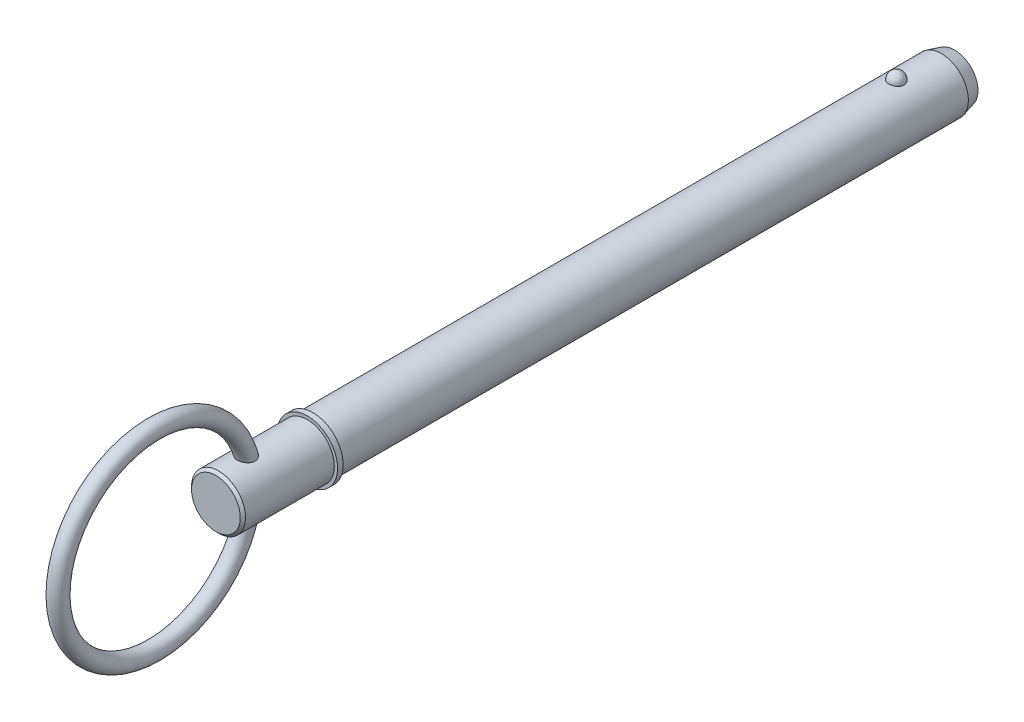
ISO-10303-21;
HEADER;
FILE_DESCRIPTION(('STEP AP214'),'2;1');
FILE_NAME('part.step','',(''),(''),'','','');
FILE_SCHEMA(('AUTOMOTIVE_DESIGN { 1 0 10303 214 1 1 1 1 }'));
ENDSEC;
DATA;
#1=APPLICATION_CONTEXT('core data for automotive mechanical design processes');
#2=APPLICATION_PROTOCOL_DEFINITION('international standard','automotive_design',2000,#1);
#3=PRODUCT_CONTEXT('',#1,'mechanical');
#4=PRODUCT('Part','Part','',(#3));
#5=PRODUCT_RELATED_PRODUCT_CATEGORY('part','',(#4));
#6=PRODUCT_DEFINITION_FORMATION('','',#4);
#7=PRODUCT_DEFINITION_CONTEXT('part definition',#1,'design');
#8=PRODUCT_DEFINITION('design','',#6,#7);
#9=PRODUCT_DEFINITION_SHAPE('','',#8);
#10=(LENGTH_UNIT() NAMED_UNIT(*) SI_UNIT(.MILLI.,.METRE.));
#11=(NAMED_UNIT(*) PLANE_ANGLE_UNIT() SI_UNIT($,.RADIAN.));
#12=(NAMED_UNIT(*) SI_UNIT($,.STERADIAN.) SOLID_ANGLE_UNIT());
#13=UNCERTAINTY_MEASURE_WITH_UNIT(LENGTH_MEASURE(1.E-05),#10,'distance_accuracy_value','');
#14=(GEOMETRIC_REPRESENTATION_CONTEXT(3) GLOBAL_UNCERTAINTY_ASSIGNED_CONTEXT((#13)) GLOBAL_UNIT_ASSIGNED_CONTEXT((#10,
#11,#12)) REPRESENTATION_CONTEXT('',''));
#15=CARTESIAN_POINT('',(0.,0.,0.));
#16=DIRECTION('',(0.,0.,1.));
#17=DIRECTION('',(1.,0.,0.));
#18=AXIS2_PLACEMENT_3D('',#15,#16,#17);
#19=CARTESIAN_POINT('',(0.,0.,152.4));
#20=DIRECTION('',(0.,0.,-1.));
#21=DIRECTION('',(-1.,0.,0.));
#22=AXIS2_PLACEMENT_3D('',#19,#20,#21);
#23=CYLINDRICAL_SURFACE('',#22,7.145);
#24=CARTESIAN_POINT('',(1.99971637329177,6.85945766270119,-2.01999999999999));
#25=CARTESIAN_POINT('',(1.9997145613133,6.85945924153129,-1.90709736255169));
#26=CARTESIAN_POINT('',(1.99051486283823,6.86216053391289,-1.79417185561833));
#27=CARTESIAN_POINT('',(1.95393597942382,6.87266409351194,-1.57152267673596));
#28=CARTESIAN_POINT('',(1.92655029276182,6.88046818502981,-1.46180016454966));
#29=CARTESIAN_POINT('',(1.85429435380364,6.90029063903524,-1.24873107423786));
#30=CARTESIAN_POINT('',(1.80943177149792,6.91230715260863,-1.14538172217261));
#31=CARTESIAN_POINT('',(1.70333474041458,6.93921158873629,-0.947875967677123));
#32=CARTESIAN_POINT('',(1.64210059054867,6.95409945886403,-0.853719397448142));
#33=CARTESIAN_POINT('',(1.5044381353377,6.98517577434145,-0.676721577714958));
#34=CARTESIAN_POINT('',(1.42793505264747,7.00137037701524,-0.593939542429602));
#35=CARTESIAN_POINT('',(1.26189697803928,7.03319066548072,-0.442536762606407));
#36=CARTESIAN_POINT('',(1.17236198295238,7.04881635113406,-0.373916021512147));
#37=CARTESIAN_POINT('',(0.9829322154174,7.0777121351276,-0.252935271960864));
#38=CARTESIAN_POINT('',(0.88306843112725,7.09098897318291,-0.200528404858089));
#39=CARTESIAN_POINT('',(0.675560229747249,7.11375589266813,-0.113212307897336));
#40=CARTESIAN_POINT('',(0.567916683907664,7.12324639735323,-0.0783011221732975));
#41=CARTESIAN_POINT('',(0.350006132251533,7.13724173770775,-0.0274707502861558));
#42=CARTESIAN_POINT('',(0.239822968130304,7.14183447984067,-0.0112162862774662));
#43=CARTESIAN_POINT('',(0.0181946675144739,7.14583597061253,0.00296794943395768));
#44=CARTESIAN_POINT('',(-0.093250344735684,7.14524522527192,0.000899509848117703));
#45=CARTESIAN_POINT('',(-0.31252760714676,7.13899247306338,-0.0213331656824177));
#46=CARTESIAN_POINT('',(-0.420388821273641,7.13340426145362,-0.0412340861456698));
#47=CARTESIAN_POINT('',(-0.631141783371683,7.11785474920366,-0.0982040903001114));
#48=CARTESIAN_POINT('',(-0.73403344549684,7.10789337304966,-0.135273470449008));
#49=CARTESIAN_POINT('',(-0.932634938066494,7.08458058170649,-0.225826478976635));
#50=CARTESIAN_POINT('',(-1.02829911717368,7.07120963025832,-0.279405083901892));
#51=CARTESIAN_POINT('',(-1.20927180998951,7.04252043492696,-0.401457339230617));
#52=CARTESIAN_POINT('',(-1.29457925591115,7.02720199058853,-0.469932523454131));
#53=CARTESIAN_POINT('',(-1.45423311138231,6.995926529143,-0.621438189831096));
#54=CARTESIAN_POINT('',(-1.5283348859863,6.97996288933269,-0.704725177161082));
#55=CARTESIAN_POINT('',(-1.66169281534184,6.94942414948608,-0.882667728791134));
#56=CARTESIAN_POINT('',(-1.72094789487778,6.93484915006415,-0.977324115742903));
#57=CARTESIAN_POINT('',(-1.82375276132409,6.90853186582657,-1.17661373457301));
#58=CARTESIAN_POINT('',(-1.86711024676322,6.8968248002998,-1.28135093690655));
#59=CARTESIAN_POINT('',(-1.9360425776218,6.87779420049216,-1.49689986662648));
#60=CARTESIAN_POINT('',(-1.96161794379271,6.87047053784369,-1.60771141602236));
#61=CARTESIAN_POINT('',(-1.99427437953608,6.86106309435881,-1.83176258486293));
#62=CARTESIAN_POINT('',(-2.00143373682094,6.8589571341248,-1.94498985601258));
#63=CARTESIAN_POINT('',(-1.99730449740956,6.86016064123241,-2.17107603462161));
#64=CARTESIAN_POINT('',(-1.98601641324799,6.86346995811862,-2.28393495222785));
#65=CARTESIAN_POINT('',(-1.94538181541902,6.87509649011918,-2.50548437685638));
#66=CARTESIAN_POINT('',(-1.91612773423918,6.88338806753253,-2.61419321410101));
#67=CARTESIAN_POINT('',(-1.84036449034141,6.90402888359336,-2.82501243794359));
#68=CARTESIAN_POINT('',(-1.79385462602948,6.91637828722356,-2.92712255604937));
#69=CARTESIAN_POINT('',(-1.68442067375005,6.94384180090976,-3.122477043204));
#70=CARTESIAN_POINT('',(-1.62140729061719,6.95897081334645,-3.21566929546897));
#71=CARTESIAN_POINT('',(-1.4806650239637,6.99026742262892,-3.38999412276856));
#72=CARTESIAN_POINT('',(-1.40293556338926,7.00643506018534,-3.47112622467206));
#73=CARTESIAN_POINT('',(-1.2344320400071,7.03807960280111,-3.61938672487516));
#74=CARTESIAN_POINT('',(-1.14360929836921,7.05355363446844,-3.68646046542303));
#75=CARTESIAN_POINT('',(-0.951591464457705,7.08201263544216,-3.80431973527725));
#76=CARTESIAN_POINT('',(-0.850397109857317,7.09499778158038,-3.85510642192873));
#77=CARTESIAN_POINT('',(-0.641823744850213,7.11687679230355,-3.93839532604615));
#78=CARTESIAN_POINT('',(-0.534539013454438,7.1258202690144,-3.97112042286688));
#79=CARTESIAN_POINT('',(-0.315743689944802,7.1388605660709,-4.01830716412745));
#80=CARTESIAN_POINT('',(-0.204233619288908,7.14295798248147,-4.03277105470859));
#81=CARTESIAN_POINT('',(0.0175518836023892,7.14582273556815,-4.04291389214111));
#82=CARTESIAN_POINT('',(0.12780991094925,7.14469090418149,-4.03894819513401));
#83=CARTESIAN_POINT('',(0.346044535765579,7.13745046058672,-4.01315850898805));
#84=CARTESIAN_POINT('',(0.454021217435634,7.13134203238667,-3.99133518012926));
#85=CARTESIAN_POINT('',(0.664227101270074,7.11483713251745,-3.93057164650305));
#86=CARTESIAN_POINT('',(0.766477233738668,7.10445761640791,-3.89169908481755));
#87=CARTESIAN_POINT('',(0.962929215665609,7.08050813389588,-3.79792023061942));
#88=CARTESIAN_POINT('',(1.05713054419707,7.06693796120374,-3.74301290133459));
#89=CARTESIAN_POINT('',(1.23644031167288,7.03780007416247,-3.61765173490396));
#90=CARTESIAN_POINT('',(1.32138387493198,7.0222044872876,-3.54696861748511));
#91=CARTESIAN_POINT('',(1.47830582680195,6.99085504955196,-3.39245228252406));
#92=CARTESIAN_POINT('',(1.55028198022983,6.97510117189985,-3.30861680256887));
#93=CARTESIAN_POINT('',(1.68063701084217,6.94485803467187,-3.12843058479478));
#94=CARTESIAN_POINT('',(1.73875175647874,6.93039619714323,-3.03188405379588));
#95=CARTESIAN_POINT('',(1.83823393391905,6.90467783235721,-2.83015210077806));
#96=CARTESIAN_POINT('',(1.87960712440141,6.89342020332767,-2.72496966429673));
#97=CARTESIAN_POINT('',(1.94111647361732,6.87633596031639,-2.52050234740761));
#98=CARTESIAN_POINT('',(1.96305249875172,6.87005682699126,-2.42179225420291));
#99=CARTESIAN_POINT('',(1.99235308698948,6.86161702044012,-2.22206084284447));
#100=CARTESIAN_POINT('',(1.99971799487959,6.85945624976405,-2.12103957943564));
#101=CARTESIAN_POINT('',(1.99971637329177,6.85945766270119,-2.01999999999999));
#102=B_SPLINE_CURVE_WITH_KNOTS('',3,(#24,#25,#26,#27,#28,#29,#30,#31,#32,#33,#34,#35,#36,#37,
#38,#39,#40,#41,#42,#43,#44,#45,#46,#47,#48,#49,#50,#51,#52,#53,#54,#55,#56,#57,#58,#59,#60,#61,
#62,#63,#64,#65,#66,#67,#68,#69,#70,#71,#72,#73,#74,#75,#76,#77,#78,#79,#80,#81,#82,#83,#84,#85,
#86,#87,#88,#89,#90,#91,#92,#93,#94,#95,#96,#97,#98,#99,#100,#101),.UNSPECIFIED.,.T.,.F.,(4,2,2,
2,2,2,2,2,2,2,2,2,2,2,2,2,2,2,2,2,2,2,2,2,2,2,2,2,2,2,2,2,2,2,2,2,2,2,4),(0.,0.338345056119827,
0.676811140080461,1.01512885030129,1.35344038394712,1.69345130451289,2.0334623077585,
2.37248128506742,2.71146235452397,3.04425125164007,3.37700766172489,3.70493009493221,
4.03285819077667,4.36270921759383,4.69259422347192,5.02887632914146,5.36518278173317,
5.70543263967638,6.04567253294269,6.38446363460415,6.72324532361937,7.0602984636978,
7.39736530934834,7.73629500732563,8.07523799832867,8.4154752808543,8.7556883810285,
9.09160363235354,9.42747756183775,9.7569023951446,10.0863150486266,10.4144324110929,
10.7425709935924,11.0758313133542,11.4091490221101,11.748385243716,12.0875046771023,
12.3903058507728,12.6930998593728),.UNSPECIFIED.);
#103=CARTESIAN_POINT('',(1.99971637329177,6.85945766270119,-2.01999999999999));
#104=VERTEX_POINT('',#103);
#105=EDGE_CURVE('E102',#104,#104,#102,.T.);
#106=ORIENTED_EDGE('',*,*,#105,.T.);
#107=EDGE_LOOP('',(#106));
#108=FACE_BOUND('',#107,.T.);
#109=CARTESIAN_POINT('',(0.,0.,-13.9500000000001));
#110=DIRECTION('',(0.,0.,-1.));
#111=DIRECTION('',(-1.,0.,0.));
#112=AXIS2_PLACEMENT_3D('',#109,#110,#111);
#113=CIRCLE('',#112,7.145);
#114=CARTESIAN_POINT('',(-7.145,0.,-13.9500000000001));
#115=VERTEX_POINT('',#114);
#116=EDGE_CURVE('E109',#115,#115,#113,.F.);
#117=ORIENTED_EDGE('',*,*,#116,.T.);
#118=EDGE_LOOP('',(#117));
#119=FACE_BOUND('',#118,.T.);
#120=CARTESIAN_POINT('',(0.,0.,152.4));
#121=DIRECTION('',(0.,0.,1.));
#122=DIRECTION('',(1.,0.,0.));
#123=AXIS2_PLACEMENT_3D('',#120,#121,#122);
#124=CIRCLE('',#123,7.145);
#125=CARTESIAN_POINT('',(7.145,0.,152.4));
#126=VERTEX_POINT('',#125);
#127=EDGE_CURVE('E107',#126,#126,#124,.T.);
#128=ORIENTED_EDGE('',*,*,#127,.F.);
#129=EDGE_LOOP('',(#128));
#130=FACE_BOUND('',#129,.T.);
#131=ADVANCED_FACE('F39',(#108,#119,#130),#23,.T.);
#132=CARTESIAN_POINT('',(0.,0.,-17.45));
#133=DIRECTION('',(0.,0.,-1.));
#134=DIRECTION('',(-1.,0.,0.));
#135=AXIS2_PLACEMENT_3D('',#132,#133,#134);
#136=PLANE('',#135);
#137=CARTESIAN_POINT('',(0.,0.,-17.45));
#138=DIRECTION('',(0.,0.,-1.));
#139=DIRECTION('',(-1.,0.,0.));
#140=AXIS2_PLACEMENT_3D('',#137,#138,#139);
#141=CIRCLE('',#140,6.20717782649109);
#142=CARTESIAN_POINT('',(-6.20717782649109,0.,-17.45));
#143=VERTEX_POINT('',#142);
#144=EDGE_CURVE('E143',#143,#143,#141,.T.);
#145=ORIENTED_EDGE('',*,*,#144,.T.);
#146=EDGE_LOOP('',(#145));
#147=FACE_BOUND('',#146,.T.);
#148=ADVANCED_FACE('F88',(#147),#136,.T.);
#149=CARTESIAN_POINT('',(0.,0.,-17.45));
#150=DIRECTION('',(0.,0.,1.));
#151=DIRECTION('',(1.,0.,0.));
#152=AXIS2_PLACEMENT_3D('',#149,#150,#151);
#153=CONICAL_SURFACE('',#152,6.20717782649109,0.261799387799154);
#154=ORIENTED_EDGE('',*,*,#116,.F.);
#155=EDGE_LOOP('',(#154));
#156=FACE_BOUND('',#155,.T.);
#157=ORIENTED_EDGE('',*,*,#144,.F.);
#158=EDGE_LOOP('',(#157));
#159=FACE_BOUND('',#158,.T.);
#160=ADVANCED_FACE('F94',(#156,#159),#153,.T.);
#161=CARTESIAN_POINT('',(0.,7.145,-2.01999999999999));
#162=DIRECTION('',(0.,1.,0.));
#163=DIRECTION('',(0.,0.,1.));
#164=AXIS2_PLACEMENT_3D('',#161,#162,#163);
#165=SPHERICAL_SURFACE('',#164,2.02);
#166=ORIENTED_EDGE('',*,*,#105,.F.);
#167=EDGE_LOOP('',(#166));
#168=FACE_BOUND('',#167,.T.);
#169=ADVANCED_FACE('F112',(#168),#165,.T.);
#170=CARTESIAN_POINT('',(0.,0.,152.4));
#171=DIRECTION('',(0.,0.,-1.));
#172=DIRECTION('',(-1.,0.,0.));
#173=AXIS2_PLACEMENT_3D('',#170,#171,#172);
#174=PLANE('',#173);
#175=ORIENTED_EDGE('',*,*,#127,.T.);
#176=EDGE_LOOP('',(#175));
#177=FACE_BOUND('',#176,.T.);
#178=CARTESIAN_POINT('',(0.,0.,152.4));
#179=DIRECTION('',(0.,0.,-1.));
#180=DIRECTION('',(-1.,0.,0.));
#181=AXIS2_PLACEMENT_3D('',#178,#179,#180);
#182=CIRCLE('',#181,8.);
#183=CARTESIAN_POINT('',(-8.,0.,152.4));
#184=VERTEX_POINT('',#183);
#185=EDGE_CURVE('E108',#184,#184,#182,.T.);
#186=ORIENTED_EDGE('',*,*,#185,.T.);
#187=EDGE_LOOP('',(#186));
#188=FACE_BOUND('',#187,.T.);
#189=ADVANCED_FACE('F116',(#177,#188),#174,.T.);
#190=CARTESIAN_POINT('',(0.,0.,33.7287874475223));
#191=DIRECTION('',(0.,0.,-1.));
#192=DIRECTION('',(-1.,0.,0.));
#193=AXIS2_PLACEMENT_3D('',#190,#191,#192);
#194=CYLINDRICAL_SURFACE('',#193,8.);
#195=CARTESIAN_POINT('',(0.,0.,153.9));
#196=DIRECTION('',(0.,0.,-1.));
#197=DIRECTION('',(-1.,0.,0.));
#198=AXIS2_PLACEMENT_3D('',#195,#196,#197);
#199=CIRCLE('',#198,8.);
#200=CARTESIAN_POINT('',(-8.,0.,153.9));
#201=VERTEX_POINT('',#200);
#202=EDGE_CURVE('E133',#201,#201,#199,.T.);
#203=ORIENTED_EDGE('',*,*,#202,.T.);
#204=EDGE_LOOP('',(#203));
#205=FACE_BOUND('',#204,.T.);
#206=ORIENTED_EDGE('',*,*,#185,.F.);
#207=EDGE_LOOP('',(#206));
#208=FACE_BOUND('',#207,.T.);
#209=ADVANCED_FACE('F120',(#205,#208),#194,.T.);
#210=CARTESIAN_POINT('',(0.,8.,153.9));
#211=DIRECTION('',(0.,0.,1.));
#212=DIRECTION('',(1.,0.,0.));
#213=AXIS2_PLACEMENT_3D('',#210,#211,#212);
#214=PLANE('',#213);
#215=CARTESIAN_POINT('',(0.,0.,153.9));
#216=DIRECTION('',(0.,0.,1.));
#217=DIRECTION('',(1.,0.,0.));
#218=AXIS2_PLACEMENT_3D('',#215,#216,#217);
#219=CIRCLE('',#218,7.145);
#220=CARTESIAN_POINT('',(7.145,0.,153.9));
#221=VERTEX_POINT('',#220);
#222=EDGE_CURVE('E111',#221,#221,#219,.T.);
#223=ORIENTED_EDGE('',*,*,#222,.F.);
#224=EDGE_LOOP('',(#223));
#225=FACE_BOUND('',#224,.T.);
#226=ORIENTED_EDGE('',*,*,#202,.F.);
#227=EDGE_LOOP('',(#226));
#228=FACE_BOUND('',#227,.T.);
#229=ADVANCED_FACE('F85',(#225,#228),#214,.T.);
#230=CARTESIAN_POINT('',(0.,0.,178.1));
#231=DIRECTION('',(0.,0.,-1.));
#232=DIRECTION('',(-1.,0.,0.));
#233=AXIS2_PLACEMENT_3D('',#230,#231,#232);
#234=CYLINDRICAL_SURFACE('',#233,7.145);
#235=CARTESIAN_POINT('',(-1.03551034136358,-7.0695645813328,168.030259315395));
#236=CARTESIAN_POINT('',(-0.923225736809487,-7.08601142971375,167.974402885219));
#237=CARTESIAN_POINT('',(-0.806039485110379,-7.10042113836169,167.927835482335));
#238=CARTESIAN_POINT('',(-0.565173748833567,-7.1236385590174,167.854279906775));
#239=CARTESIAN_POINT('',(-0.441495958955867,-7.13244772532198,167.827286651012));
#240=CARTESIAN_POINT('',(-0.191106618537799,-7.14354309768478,167.793450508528));
#241=CARTESIAN_POINT('',(-0.0643945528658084,-7.14582818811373,167.786611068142));
#242=CARTESIAN_POINT('',(0.188443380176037,-7.14363337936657,167.793241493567));
#243=CARTESIAN_POINT('',(0.31456922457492,-7.13915321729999,167.806712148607));
#244=CARTESIAN_POINT('',(0.562499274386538,-7.12390574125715,167.85364165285));
#245=CARTESIAN_POINT('',(0.684308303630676,-7.11314569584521,167.887077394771));
#246=CARTESIAN_POINT('',(0.920329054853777,-7.08647538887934,167.973194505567));
#247=CARTESIAN_POINT('',(1.0345403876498,-7.07056486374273,168.025876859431));
#248=CARTESIAN_POINT('',(1.2523263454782,-7.03526161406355,168.1494470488));
#249=CARTESIAN_POINT('',(1.35588248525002,-7.01586299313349,168.22036580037));
#250=CARTESIAN_POINT('',(1.54916093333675,-6.9757352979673,168.378757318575));
#251=CARTESIAN_POINT('',(1.63888414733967,-6.95500631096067,168.466229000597));
#252=CARTESIAN_POINT('',(1.80113983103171,-6.91475703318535,168.654727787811));
#253=CARTESIAN_POINT('',(1.87381924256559,-6.89522757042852,168.755626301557));
#254=CARTESIAN_POINT('',(2.00091178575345,-6.8594283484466,168.96884010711));
#255=CARTESIAN_POINT('',(2.05532963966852,-6.84315774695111,169.081152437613));
#256=CARTESIAN_POINT('',(2.14350100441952,-6.81604873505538,169.31119481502));
#257=CARTESIAN_POINT('',(2.17770329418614,-6.80509340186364,169.428739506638));
#258=CARTESIAN_POINT('',(2.22691394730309,-6.7891497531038,169.668149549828));
#259=CARTESIAN_POINT('',(2.2419216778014,-6.7841616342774,169.790015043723));
#260=CARTESIAN_POINT('',(2.25313992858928,-6.78044381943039,170.03580699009));
#261=CARTESIAN_POINT('',(2.24917302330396,-6.78177319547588,170.159742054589));
#262=CARTESIAN_POINT('',(2.22301329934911,-6.79039131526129,170.405438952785));
#263=CARTESIAN_POINT('',(2.20081491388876,-6.79768187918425,170.5272001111));
#264=CARTESIAN_POINT('',(2.13702421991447,-6.81801706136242,170.775287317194));
#265=CARTESIAN_POINT('',(2.09404815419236,-6.83146790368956,170.901223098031));
#266=CARTESIAN_POINT('',(1.98986384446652,-6.86253672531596,171.144824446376));
#267=CARTESIAN_POINT('',(1.92864130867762,-6.88015796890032,171.262483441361));
#268=CARTESIAN_POINT('',(1.78274362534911,-6.91947130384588,171.497497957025));
#269=CARTESIAN_POINT('',(1.69640701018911,-6.94139021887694,171.613789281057));
#270=CARTESIAN_POINT('',(1.50503944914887,-6.98537683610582,171.829799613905));
#271=CARTESIAN_POINT('',(1.40001969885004,-7.00744444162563,171.929528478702));
#272=CARTESIAN_POINT('',(1.19221781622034,-7.04548349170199,172.093170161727));
#273=CARTESIAN_POINT('',(1.09203347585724,-7.06185586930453,172.16028599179));
#274=CARTESIAN_POINT('',(0.881607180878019,-7.09119477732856,172.277337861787));
#275=CARTESIAN_POINT('',(0.771372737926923,-7.10416382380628,172.327286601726));
#276=CARTESIAN_POINT('',(0.542622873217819,-7.12529560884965,172.407475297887));
#277=CARTESIAN_POINT('',(0.424058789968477,-7.13342692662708,172.43758654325));
#278=CARTESIAN_POINT('',(0.183155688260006,-7.14366628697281,172.475370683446));
#279=CARTESIAN_POINT('',(0.0608191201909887,-7.14577815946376,172.483057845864));
#280=CARTESIAN_POINT('',(-0.169367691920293,-7.14381572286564,172.475860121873));
#281=CARTESIAN_POINT('',(-0.277308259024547,-7.14040669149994,172.463402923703));
#282=CARTESIAN_POINT('',(-0.489468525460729,-7.12900651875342,172.421156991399));
#283=CARTESIAN_POINT('',(-0.593687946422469,-7.12101503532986,172.391366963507));
#284=CARTESIAN_POINT('',(-0.796149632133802,-7.10123695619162,172.315987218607));
#285=CARTESIAN_POINT('',(-0.894373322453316,-7.08943921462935,172.270351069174));
#286=CARTESIAN_POINT('',(-1.08274371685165,-7.06312621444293,172.165336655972));
#287=CARTESIAN_POINT('',(-1.17288754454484,-7.04860999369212,172.105953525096));
#288=CARTESIAN_POINT('',(-1.35484961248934,-7.01605385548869,171.967113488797));
#289=CARTESIAN_POINT('',(-1.44541008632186,-6.99780069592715,171.886061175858));
#290=CARTESIAN_POINT('',(-1.61364655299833,-6.96093393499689,171.711599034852));
#291=CARTESIAN_POINT('',(-1.69131381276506,-6.94232009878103,171.618180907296));
#292=CARTESIAN_POINT('',(-1.843300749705,-6.90364386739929,171.406608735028));
#293=CARTESIAN_POINT('',(-1.9154309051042,-6.88377370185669,171.286839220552));
#294=CARTESIAN_POINT('',(-2.04002946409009,-6.84788436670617,171.036875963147));
#295=CARTESIAN_POINT('',(-2.09248830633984,-6.83186707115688,170.906677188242));
#296=CARTESIAN_POINT('',(-2.17795964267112,-6.80511869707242,170.632555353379));
#297=CARTESIAN_POINT('',(-2.20992909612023,-6.79467512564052,170.488274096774));
#298=CARTESIAN_POINT('',(-2.24813111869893,-6.78213595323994,170.195984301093));
#299=CARTESIAN_POINT('',(-2.25438316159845,-6.78003403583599,170.047978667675));
#300=CARTESIAN_POINT('',(-2.24011368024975,-6.78475868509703,169.765430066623));
#301=CARTESIAN_POINT('',(-2.22172362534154,-6.79087455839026,169.630769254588));
#302=CARTESIAN_POINT('',(-2.16145328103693,-6.81029672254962,169.367367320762));
#303=CARTESIAN_POINT('',(-2.11958615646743,-6.82359898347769,169.238622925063));
#304=CARTESIAN_POINT('',(-2.01784121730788,-6.85433303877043,169.002267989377));
#305=CARTESIAN_POINT('',(-1.95982394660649,-6.8713108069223,168.893792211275));
#306=CARTESIAN_POINT('',(-1.8264215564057,-6.90796511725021,168.688591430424));
#307=CARTESIAN_POINT('',(-1.75103235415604,-6.92764229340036,168.591869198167));
#308=CARTESIAN_POINT('',(-1.57825515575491,-6.96911949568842,168.405408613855));
#309=CARTESIAN_POINT('',(-1.47957996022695,-6.99096237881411,168.31687037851));
#310=CARTESIAN_POINT('',(-1.26760341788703,-7.0324852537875,168.158840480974));
#311=CARTESIAN_POINT('',(-1.15429989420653,-7.05216492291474,168.089351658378));
#312=CARTESIAN_POINT('',(-1.03551034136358,-7.0695645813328,168.030259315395));
#313=B_SPLINE_CURVE_WITH_KNOTS('',3,(#235,#236,#237,#238,#239,#240,#241,#242,#243,#244,#245,
#246,#247,#248,#249,#250,#251,#252,#253,#254,#255,#256,#257,#258,#259,#260,#261,#262,#263,#264,
#265,#266,#267,#268,#269,#270,#271,#272,#273,#274,#275,#276,#277,#278,#279,#280,#281,#282,#283,
#284,#285,#286,#287,#288,#289,#290,#291,#292,#293,#294,#295,#296,#297,#298,#299,#300,#301,#302,
#303,#304,#305,#306,#307,#308,#309,#310,#311,#312),.UNSPECIFIED.,.T.,.F.,(4,2,2,2,2,2,2,2,2,2,2,
2,2,2,2,2,2,2,2,2,2,2,2,2,2,2,2,2,2,2,2,2,2,2,2,2,2,2,4),(0.,0.378979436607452,
0.757860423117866,1.13680619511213,1.51576669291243,1.89428943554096,2.27283155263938,
2.65201969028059,3.03118299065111,3.40694616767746,3.78261210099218,4.14959041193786,
4.51658082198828,4.88700951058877,5.25755134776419,5.65713708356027,6.0570366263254,
6.49445595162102,6.93161403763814,7.29520224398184,7.65852089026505,8.02417421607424,
8.38959483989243,8.71415763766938,9.03874466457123,9.36429093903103,9.68995264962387,
10.057225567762,10.4247462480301,10.8465602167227,11.2685789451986,11.7106604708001,
12.152407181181,12.5583067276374,12.9639788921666,13.3347314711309,13.7055712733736,
14.1064462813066,14.5073810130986),.UNSPECIFIED.);
#314=CARTESIAN_POINT('',(-1.03551034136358,-7.0695645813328,168.030259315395));
#315=VERTEX_POINT('',#314);
#316=EDGE_CURVE('E10',#315,#315,#313,.T.);
#317=ORIENTED_EDGE('',*,*,#316,.F.);
#318=EDGE_LOOP('',(#317));
#319=FACE_BOUND('',#318,.T.);
#320=CARTESIAN_POINT('',(-1.03551034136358,7.0695645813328,168.030259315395));
#321=CARTESIAN_POINT('',(-1.14644953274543,7.05331457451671,168.085446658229));
#322=CARTESIAN_POINT('',(-1.25260902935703,7.03507806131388,168.149702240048));
#323=CARTESIAN_POINT('',(-1.45240021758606,6.99656564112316,168.294958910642));
#324=CARTESIAN_POINT('',(-1.54602879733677,6.97628922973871,168.375964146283));
#325=CARTESIAN_POINT('',(-1.71815091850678,6.93590796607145,168.552910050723));
#326=CARTESIAN_POINT('',(-1.79663177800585,6.91580327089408,168.648863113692));
#327=CARTESIAN_POINT('',(-1.9360771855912,6.87807159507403,168.853162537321));
#328=CARTESIAN_POINT('',(-1.99704642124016,6.86044395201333,168.961505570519));
#329=CARTESIAN_POINT('',(-2.09894945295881,6.82995115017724,169.185542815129));
#330=CARTESIAN_POINT('',(-2.1402125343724,6.81700866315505,169.301076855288));
#331=CARTESIAN_POINT('',(-2.20347311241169,6.79682602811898,169.537758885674));
#332=CARTESIAN_POINT('',(-2.22547114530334,6.78958572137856,169.658906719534));
#333=CARTESIAN_POINT('',(-2.25026114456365,6.78140983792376,169.903214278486));
#334=CARTESIAN_POINT('',(-2.25306986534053,6.78046876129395,170.02637215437));
#335=CARTESIAN_POINT('',(-2.2403056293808,6.78469532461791,170.271604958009));
#336=CARTESIAN_POINT('',(-2.22472720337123,6.78986478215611,170.393679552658));
#337=CARTESIAN_POINT('',(-2.17472134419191,6.8060520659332,170.642036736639));
#338=CARTESIAN_POINT('',(-2.13910164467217,6.81743831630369,170.768053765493));
#339=CARTESIAN_POINT('',(-2.04975058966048,6.84483151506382,171.012973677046));
#340=CARTESIAN_POINT('',(-1.99600968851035,6.86084089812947,171.131872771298));
#341=CARTESIAN_POINT('',(-1.86558545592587,6.8975101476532,171.371425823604));
#342=CARTESIAN_POINT('',(-1.78715729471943,6.91847353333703,171.491087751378));
#343=CARTESIAN_POINT('',(-1.61149373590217,6.96148580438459,171.715646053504));
#344=CARTESIAN_POINT('',(-1.51424701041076,6.98353533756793,171.82053346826));
#345=CARTESIAN_POINT('',(-1.30107590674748,7.02639179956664,172.012951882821));
#346=CARTESIAN_POINT('',(-1.1849228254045,7.04717858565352,172.100236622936));
#347=CARTESIAN_POINT('',(-0.937392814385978,7.08434208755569,172.250827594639));
#348=CARTESIAN_POINT('',(-0.806039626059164,7.10072555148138,172.314170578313));
#349=CARTESIAN_POINT('',(-0.550470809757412,7.12475629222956,172.405483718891));
#350=CARTESIAN_POINT('',(-0.427643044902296,7.13327781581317,172.437047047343));
#351=CARTESIAN_POINT('',(-0.240556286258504,7.14122488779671,172.466356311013));
#352=CARTESIAN_POINT('',(-0.177714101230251,7.14306799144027,172.473119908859));
#353=CARTESIAN_POINT('',(-0.0516470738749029,7.14509121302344,172.480539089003));
#354=CARTESIAN_POINT('',(0.0115777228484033,7.14527152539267,172.481195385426));
#355=CARTESIAN_POINT('',(0.182932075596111,7.14347436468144,172.474616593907));
#356=CARTESIAN_POINT('',(0.290871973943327,7.13986325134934,172.461408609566));
#357=CARTESIAN_POINT('',(0.502842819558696,7.1280769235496,172.417690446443));
#358=CARTESIAN_POINT('',(0.606873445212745,7.11990133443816,172.387178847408));
#359=CARTESIAN_POINT('',(0.809001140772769,7.09978218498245,172.310378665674));
#360=CARTESIAN_POINT('',(0.907071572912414,7.08782300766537,172.264024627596));
#361=CARTESIAN_POINT('',(1.09503957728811,7.0612282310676,172.157620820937));
#362=CARTESIAN_POINT('',(1.18493426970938,7.04659169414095,172.097566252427));
#363=CARTESIAN_POINT('',(1.36644041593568,7.01380352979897,171.957233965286));
#364=CARTESIAN_POINT('',(1.45676563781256,6.99544216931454,171.875344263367));
#365=CARTESIAN_POINT('',(1.62440639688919,6.95842750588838,171.699231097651));
#366=CARTESIAN_POINT('',(1.70171298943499,6.93977401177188,171.604999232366));
#367=CARTESIAN_POINT('',(1.8527160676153,6.90111647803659,171.391807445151));
#368=CARTESIAN_POINT('',(1.92421731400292,6.88131605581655,171.271248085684));
#369=CARTESIAN_POINT('',(2.04739198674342,6.84567995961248,171.019785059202));
#370=CARTESIAN_POINT('',(2.09905621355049,6.82984612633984,170.888876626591));
#371=CARTESIAN_POINT('',(2.1825776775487,6.80363167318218,170.613847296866));
#372=CARTESIAN_POINT('',(2.21345394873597,6.79352430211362,170.469397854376));
#373=CARTESIAN_POINT('',(2.24941288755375,6.78170753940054,170.176984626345));
#374=CARTESIAN_POINT('',(2.2545156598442,6.77999160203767,170.029023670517));
#375=CARTESIAN_POINT('',(2.2380435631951,6.78544298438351,169.747053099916));
#376=CARTESIAN_POINT('',(2.21864521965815,6.79188566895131,169.612903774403));
#377=CARTESIAN_POINT('',(2.15648766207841,6.81187529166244,169.350690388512));
#378=CARTESIAN_POINT('',(2.11373989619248,6.82541874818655,169.22262337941));
#379=CARTESIAN_POINT('',(2.01040099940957,6.85652522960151,168.987507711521));
#380=CARTESIAN_POINT('',(1.9516260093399,6.87365110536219,168.879597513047));
#381=CARTESIAN_POINT('',(1.81683142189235,6.91050025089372,168.675649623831));
#382=CARTESIAN_POINT('',(1.74081238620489,6.93022343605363,168.579611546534));
#383=CARTESIAN_POINT('',(1.57431234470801,6.96992220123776,168.40254183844));
#384=CARTESIAN_POINT('',(1.48394688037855,6.98989467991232,168.321400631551));
#385=CARTESIAN_POINT('',(1.29081365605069,7.02812243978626,168.175038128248));
#386=CARTESIAN_POINT('',(1.18804491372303,7.04637758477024,168.109818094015));
#387=CARTESIAN_POINT('',(0.970386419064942,7.07967210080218,167.995377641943));
#388=CARTESIAN_POINT('',(0.855272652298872,7.09462807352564,167.946558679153));
#389=CARTESIAN_POINT('',(0.618143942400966,7.11920826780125,167.868071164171));
#390=CARTESIAN_POINT('',(0.49612834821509,7.12883198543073,167.838404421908));
#391=CARTESIAN_POINT('',(0.247581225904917,7.14180209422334,167.798698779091));
#392=CARTESIAN_POINT('',(0.121020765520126,7.14509609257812,167.788823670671));
#393=CARTESIAN_POINT('',(-0.132022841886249,7.14489967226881,167.789415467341));
#394=CARTESIAN_POINT('',(-0.2585060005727,7.14141109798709,167.799876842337));
#395=CARTESIAN_POINT('',(-0.496649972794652,7.12862600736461,167.839053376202));
#396=CARTESIAN_POINT('',(-0.608625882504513,7.11987587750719,167.866055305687));
#397=CARTESIAN_POINT('',(-0.826925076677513,7.09783467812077,167.936222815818));
#398=CARTESIAN_POINT('',(-0.933248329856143,7.08454358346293,167.979388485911));
#399=CARTESIAN_POINT('',(-1.03551034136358,7.0695645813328,168.030259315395));
#400=B_SPLINE_CURVE_WITH_KNOTS('',3,(#320,#321,#322,#323,#324,#325,#326,#327,#328,#329,#330,
#331,#332,#333,#334,#335,#336,#337,#338,#339,#340,#341,#342,#343,#344,#345,#346,#347,#348,#349,
#350,#351,#352,#353,#354,#355,#356,#357,#358,#359,#360,#361,#362,#363,#364,#365,#366,#367,#368,
#369,#370,#371,#372,#373,#374,#375,#376,#377,#378,#379,#380,#381,#382,#383,#384,#385,#386,#387,
#388,#389,#390,#391,#392,#393,#394,#395,#396,#397,#398,#399),.UNSPECIFIED.,.T.,.F.,(4,2,2,2,2,2,
2,2,2,2,2,2,2,2,2,2,2,2,2,2,2,2,2,2,2,2,2,2,2,2,2,2,2,2,2,2,2,2,2,4),(0.,0.374504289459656,
0.749101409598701,1.12401080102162,1.49881974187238,1.86712525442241,2.23542051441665,
2.60339417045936,2.97147730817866,3.36420696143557,3.75714381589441,4.18898920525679,
4.62109535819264,5.05888124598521,5.49599234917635,5.87475353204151,6.06416800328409,
6.25356032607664,6.57826179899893,6.90298992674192,7.22907626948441,7.55527703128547,
7.92373585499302,8.29244681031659,8.71527472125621,9.13829848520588,9.58009907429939,
10.0215549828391,10.4264139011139,10.831074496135,11.2014904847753,11.571894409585,
11.9394538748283,12.3070424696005,12.6830655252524,13.0591241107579,13.4382822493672,
13.8173372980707,14.1625475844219,14.5077597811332),.UNSPECIFIED.);
#401=CARTESIAN_POINT('',(-1.03551034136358,7.0695645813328,168.030259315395));
#402=VERTEX_POINT('',#401);
#403=EDGE_CURVE('E51',#402,#402,#400,.T.);
#404=ORIENTED_EDGE('',*,*,#403,.F.);
#405=EDGE_LOOP('',(#404));
#406=FACE_BOUND('',#405,.T.);
#407=CARTESIAN_POINT('',(0.,0.,177.4));
#408=DIRECTION('',(0.,0.,-1.));
#409=DIRECTION('',(-1.,0.,0.));
#410=AXIS2_PLACEMENT_3D('',#407,#408,#409);
#411=CIRCLE('',#410,7.145);
#412=CARTESIAN_POINT('',(-7.145,0.,177.4));
#413=VERTEX_POINT('',#412);
#414=EDGE_CURVE('E64',#413,#413,#411,.T.);
#415=ORIENTED_EDGE('',*,*,#414,.T.);
#416=EDGE_LOOP('',(#415));
#417=FACE_BOUND('',#416,.T.);
#418=ORIENTED_EDGE('',*,*,#222,.T.);
#419=EDGE_LOOP('',(#418));
#420=FACE_BOUND('',#419,.T.);
#421=ADVANCED_FACE('F69',(#319,#406,#417,#420),#234,.T.);
#422=CARTESIAN_POINT('',(0.,0.,178.1));
#423=DIRECTION('',(0.,0.,-1.));
#424=DIRECTION('',(-1.,0.,0.));
#425=AXIS2_PLACEMENT_3D('',#422,#423,#424);
#426=PLANE('',#425);
#427=CARTESIAN_POINT('',(0.,0.,178.1));
#428=DIRECTION('',(0.,0.,-1.));
#429=DIRECTION('',(-1.,0.,0.));
#430=AXIS2_PLACEMENT_3D('',#427,#428,#429);
#431=CIRCLE('',#430,6.44499999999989);
#432=CARTESIAN_POINT('',(-6.44499999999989,0.,178.1));
#433=VERTEX_POINT('',#432);
#434=EDGE_CURVE('E58',#433,#433,#431,.F.);
#435=ORIENTED_EDGE('',*,*,#434,.T.);
#436=EDGE_LOOP('',(#435));
#437=FACE_BOUND('',#436,.T.);
#438=ADVANCED_FACE('F76',(#437),#426,.F.);
#439=CARTESIAN_POINT('',(0.,0.,177.4));
#440=DIRECTION('',(0.,0.,-1.));
#441=DIRECTION('',(-1.,0.,0.));
#442=AXIS2_PLACEMENT_3D('',#439,#440,#441);
#443=CONICAL_SURFACE('',#442,7.145,0.78539816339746);
#444=ORIENTED_EDGE('',*,*,#434,.F.);
#445=EDGE_LOOP('',(#444));
#446=FACE_BOUND('',#445,.T.);
#447=ORIENTED_EDGE('',*,*,#414,.F.);
#448=EDGE_LOOP('',(#447));
#449=FACE_BOUND('',#448,.T.);
#450=ADVANCED_FACE('F41',(#446,#449),#443,.T.);
#451=CARTESIAN_POINT('',(0.,0.,194.5));
#452=DIRECTION('',(1.,0.,0.));
#453=DIRECTION('',(0.,0.,-1.));
#454=AXIS2_PLACEMENT_3D('',#451,#452,#453);
#455=TOROIDAL_SURFACE('',#454,25.4,2.25);
#456=ORIENTED_EDGE('',*,*,#316,.T.);
#457=EDGE_LOOP('',(#456));
#458=FACE_BOUND('',#457,.T.);
#459=ORIENTED_EDGE('',*,*,#403,.T.);
#460=EDGE_LOOP('',(#459));
#461=FACE_BOUND('',#460,.T.);
#462=ADVANCED_FACE('F73',(#458,#461),#455,.T.);
#463=CLOSED_SHELL('',(#131,#148,#160,#169,#189,#209,#229,#421,#438,#450,#462));
#464=MANIFOLD_SOLID_BREP('B2',#463);
#465=ADVANCED_BREP_SHAPE_REPRESENTATION('',(#18,#464),#14);
#466=SHAPE_DEFINITION_REPRESENTATION(#9,#465);
ENDSEC;
END-ISO-10303-21;
